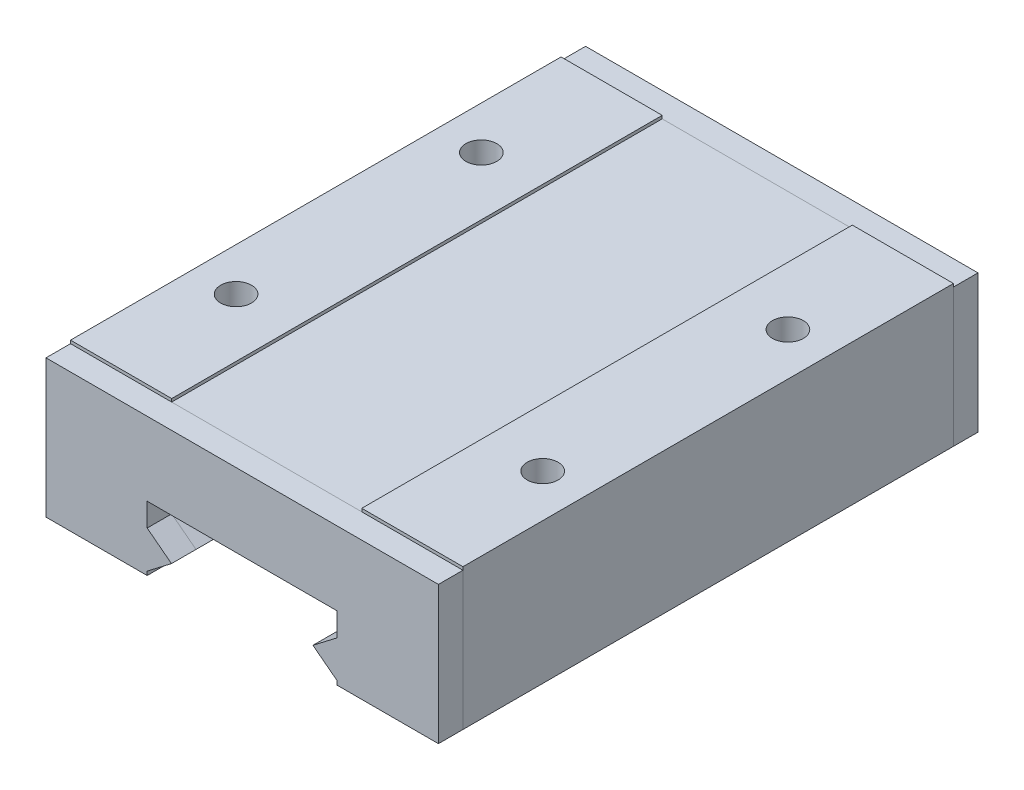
from build123d import *

# Parameters (mm, degrees)
CARRIAGE_DEPTH   = 20
SIDE_SEAL1_DEPTH = 2
SIDE_SEAL2_DEPTH = 2
SKETCH11_R       = 1.26
HOLE_DEPTH       = 4


with BuildPart() as part:
    # Sketch3 → Carriage (new, symmetric)
    with BuildSketch(Plane.XY):
        Polygon((-16, 16), (-7.75, 16), (-7.75, 15.75), (7.75, 15.75), (7.75, 16), (16, 16), (16, 4.5), (7.75, 4.5), (7.75, 4.812347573), (5.767812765, 6.333333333), (7.75, 7.854319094), (7.75, 9.75), (-7.75, 9.75), (-7.75, 7.854319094), (-5.767812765, 6.333333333), (-7.75, 4.812347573), (-7.75, 4.5), (-16, 4.5), align=None)
    extrude(amount=CARRIAGE_DEPTH, both=True)

    # Sketch11 → Hole (cut)
    with BuildSketch(Plane(origin=(0, 16, 0), x_dir=(-1, 0, 0), z_dir=(0, 1, 0))):
        with Locations((-12.5, 10)):
            Circle(SKETCH11_R)
        with Locations((12.5, 10)):
            Circle(SKETCH11_R)
        with Locations((12.5, -10)):
            Circle(SKETCH11_R)
        with Locations((-12.5, -10)):
            Circle(SKETCH11_R)
    extrude(amount=-HOLE_DEPTH, mode=Mode.SUBTRACT)


with BuildPart() as body_2:
    # Sketch4 → Side-seal1 (new body)
    with BuildSketch(Plane.XY.offset(20)):
        Polygon((-16, 15.75), (16, 15.75), (16, 4.5), (7.75, 4.5), (7.75, 4.812347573), (5.767812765, 6.333333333), (7.75, 7.854319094), (7.75, 9.75), (-7.75, 9.75), (-7.75, 7.854319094), (-5.767812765, 6.333333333), (-7.75, 4.812347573), (-7.75, 4.5), (-16, 4.5), align=None)
    extrude(amount=SIDE_SEAL1_DEPTH)


with BuildPart() as body_3:
    # Sketch5 → Side-seal2 (new body)
    with BuildSketch(Plane.XY.offset(-22)):
        Polygon((-16, 4.5), (-7.75, 4.5), (-7.75, 4.812347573), (-5.767812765, 6.333333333), (-7.75, 7.854319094), (-7.75, 9.75), (7.75, 9.75), (7.75, 7.854319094), (5.767812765, 6.333333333), (7.75, 4.812347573), (7.75, 4.5), (16, 4.5), (16, 15.75), (-16, 15.75), align=None)
    extrude(amount=SIDE_SEAL2_DEPTH)


solid = Compound([part.part, body_2.part, body_3.part])
